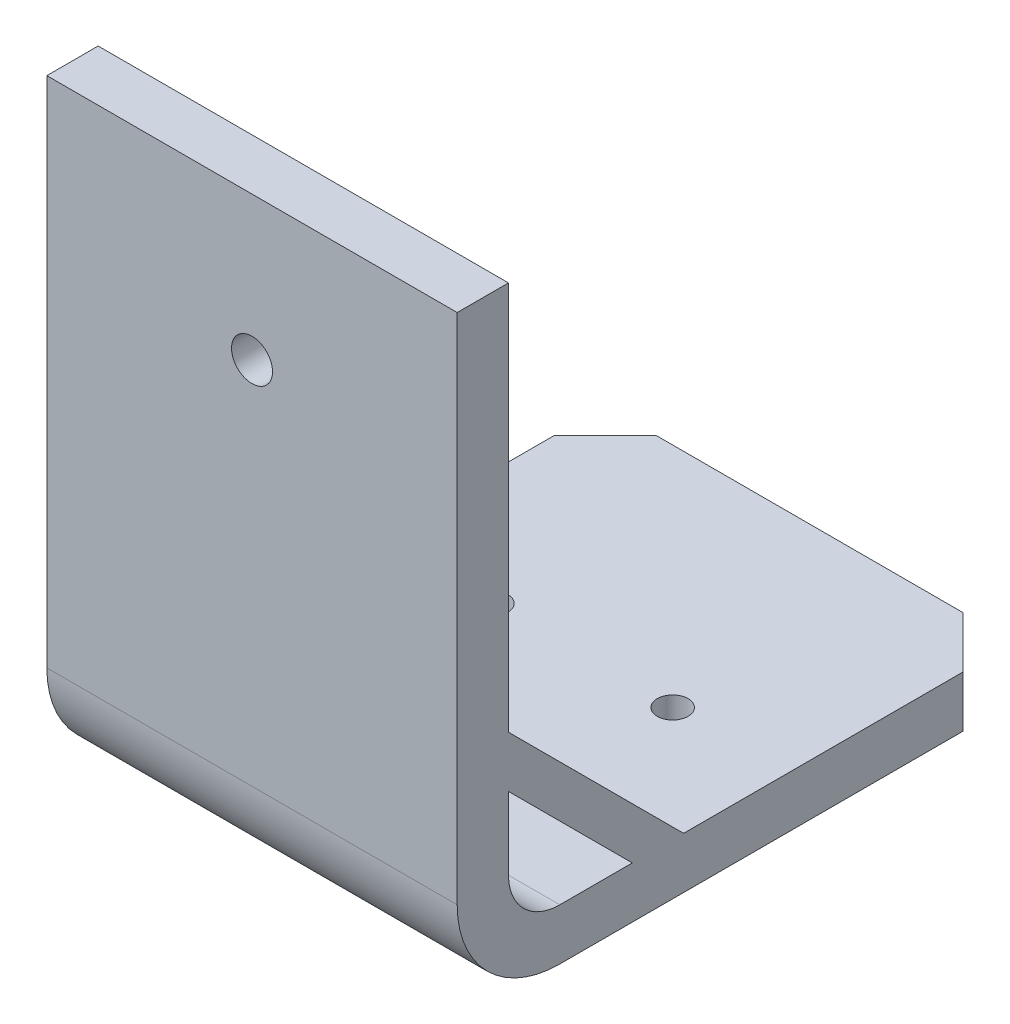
ISO-10303-21;
HEADER;
FILE_DESCRIPTION(('STEP AP214'),'2;1');
FILE_NAME('part.step','',(''),(''),'','','');
FILE_SCHEMA(('AUTOMOTIVE_DESIGN { 1 0 10303 214 1 1 1 1 }'));
ENDSEC;
DATA;
#1=APPLICATION_CONTEXT('core data for automotive mechanical design processes');
#2=APPLICATION_PROTOCOL_DEFINITION('international standard','automotive_design',2000,#1);
#3=PRODUCT_CONTEXT('',#1,'mechanical');
#4=PRODUCT('Part','Part','',(#3));
#5=PRODUCT_RELATED_PRODUCT_CATEGORY('part','',(#4));
#6=PRODUCT_DEFINITION_FORMATION('','',#4);
#7=PRODUCT_DEFINITION_CONTEXT('part definition',#1,'design');
#8=PRODUCT_DEFINITION('design','',#6,#7);
#9=PRODUCT_DEFINITION_SHAPE('','',#8);
#10=(LENGTH_UNIT() NAMED_UNIT(*) SI_UNIT(.MILLI.,.METRE.));
#11=(NAMED_UNIT(*) PLANE_ANGLE_UNIT() SI_UNIT($,.RADIAN.));
#12=(NAMED_UNIT(*) SI_UNIT($,.STERADIAN.) SOLID_ANGLE_UNIT());
#13=UNCERTAINTY_MEASURE_WITH_UNIT(LENGTH_MEASURE(1.E-05),#10,'distance_accuracy_value','');
#14=(GEOMETRIC_REPRESENTATION_CONTEXT(3) GLOBAL_UNCERTAINTY_ASSIGNED_CONTEXT((#13)) GLOBAL_UNIT_ASSIGNED_CONTEXT((#10,
#11,#12)) REPRESENTATION_CONTEXT('',''));
#15=CARTESIAN_POINT('',(0.,0.,0.));
#16=DIRECTION('',(0.,0.,1.));
#17=DIRECTION('',(1.,0.,0.));
#18=AXIS2_PLACEMENT_3D('',#15,#16,#17);
#19=CARTESIAN_POINT('',(0.,5.,0.));
#20=DIRECTION('',(0.,1.,0.));
#21=DIRECTION('',(0.,0.,1.));
#22=AXIS2_PLACEMENT_3D('',#19,#20,#21);
#23=PLANE('',#22);
#24=CARTESIAN_POINT('',(8.78818967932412,5.,0.));
#25=DIRECTION('',(0.,1.,0.));
#26=DIRECTION('',(0.,0.,1.));
#27=AXIS2_PLACEMENT_3D('',#24,#25,#26);
#28=CIRCLE('',#27,1.5);
#29=CARTESIAN_POINT('',(8.78818967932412,5.,1.5));
#30=VERTEX_POINT('',#29);
#31=EDGE_CURVE('E273',#30,#30,#28,.T.);
#32=ORIENTED_EDGE('',*,*,#31,.F.);
#33=EDGE_LOOP('',(#32));
#34=FACE_BOUND('',#33,.T.);
#35=CARTESIAN_POINT('',(-8.78071015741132,5.,0.));
#36=DIRECTION('',(0.,-1.,0.));
#37=DIRECTION('',(0.,0.,-1.));
#38=AXIS2_PLACEMENT_3D('',#35,#36,#37);
#39=CIRCLE('',#38,1.5);
#40=CARTESIAN_POINT('',(-8.78444991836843,5.,-1.49999533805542));
#41=VERTEX_POINT('',#40);
#42=CARTESIAN_POINT('',(-8.78444991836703,5.,1.49999533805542));
#43=VERTEX_POINT('',#42);
#44=EDGE_CURVE('E281',#41,#43,#39,.T.);
#45=ORIENTED_EDGE('',*,*,#44,.T.);
#46=CARTESIAN_POINT('',(-8.78818967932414,5.,0.));
#47=DIRECTION('',(0.,1.,0.));
#48=DIRECTION('',(0.,0.,1.));
#49=AXIS2_PLACEMENT_3D('',#46,#47,#48);
#50=CIRCLE('',#49,1.5);
#51=EDGE_CURVE('E266',#41,#43,#50,.T.);
#52=ORIENTED_EDGE('',*,*,#51,.F.);
#53=EDGE_LOOP('',(#45,#52));
#54=FACE_BOUND('',#53,.T.);
#55=DIRECTION('',(0.,0.,1.));
#56=VECTOR('',#55,1.);
#57=CARTESIAN_POINT('',(-19.9443884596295,5.,-17.1604316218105));
#58=LINE('',#57,#56);
#59=CARTESIAN_POINT('',(-19.9443884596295,5.,-17.1604316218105));
#60=VERTEX_POINT('',#59);
#61=CARTESIAN_POINT('',(-19.9443884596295,5.,10.0893638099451));
#62=VERTEX_POINT('',#61);
#63=EDGE_CURVE('E295',#60,#62,#58,.T.);
#64=ORIENTED_EDGE('',*,*,#63,.T.);
#65=DIRECTION('',(1.,0.,0.));
#66=VECTOR('',#65,1.);
#67=CARTESIAN_POINT('',(-20.0556115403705,5.,10.0893638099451));
#68=LINE('',#67,#66);
#69=CARTESIAN_POINT('',(19.9443884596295,5.,10.0893638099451));
#70=VERTEX_POINT('',#69);
#71=EDGE_CURVE('E376',#62,#70,#68,.T.);
#72=ORIENTED_EDGE('',*,*,#71,.T.);
#73=DIRECTION('',(0.,0.,1.));
#74=VECTOR('',#73,1.);
#75=CARTESIAN_POINT('',(19.9443884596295,5.,-17.1604316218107));
#76=LINE('',#75,#74);
#77=CARTESIAN_POINT('',(19.9443884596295,5.,-17.1604316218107));
#78=VERTEX_POINT('',#77);
#79=EDGE_CURVE('E305',#78,#70,#76,.T.);
#80=ORIENTED_EDGE('',*,*,#79,.F.);
#81=DIRECTION('',(0.707106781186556,0.,0.707106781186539));
#82=VECTOR('',#81,1.);
#83=CARTESIAN_POINT('',(14.9443884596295,5.,-22.1604316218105));
#84=LINE('',#83,#82);
#85=CARTESIAN_POINT('',(14.9443884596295,5.,-22.1604316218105));
#86=VERTEX_POINT('',#85);
#87=EDGE_CURVE('E309',#86,#78,#84,.T.);
#88=ORIENTED_EDGE('',*,*,#87,.F.);
#89=DIRECTION('',(1.,0.,0.));
#90=VECTOR('',#89,1.);
#91=CARTESIAN_POINT('',(-14.9443884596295,5.,-22.1604316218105));
#92=LINE('',#91,#90);
#93=CARTESIAN_POINT('',(-14.9443884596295,5.,-22.1604316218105));
#94=VERTEX_POINT('',#93);
#95=EDGE_CURVE('E313',#94,#86,#92,.T.);
#96=ORIENTED_EDGE('',*,*,#95,.F.);
#97=DIRECTION('',(-0.707106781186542,0.,0.707106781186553));
#98=VECTOR('',#97,1.);
#99=CARTESIAN_POINT('',(-14.9443884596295,5.,-22.1604316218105));
#100=LINE('',#99,#98);
#101=EDGE_CURVE('E289',#94,#60,#100,.T.);
#102=ORIENTED_EDGE('',*,*,#101,.T.);
#103=EDGE_LOOP('',(#64,#72,#80,#88,#96,#102));
#104=FACE_BOUND('',#103,.T.);
#105=ADVANCED_FACE('F48',(#34,#54,#104),#23,.T.);
#106=CARTESIAN_POINT('',(-20.0556115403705,10.,27.1604316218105));
#107=DIRECTION('',(0.,0.,-1.));
#108=DIRECTION('',(-1.,0.,0.));
#109=AXIS2_PLACEMENT_3D('',#106,#107,#108);
#110=PLANE('',#109);
#111=CARTESIAN_POINT('',(-0.0556115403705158,46.,27.1604316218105));
#112=DIRECTION('',(0.,0.,-1.));
#113=DIRECTION('',(-1.,0.,0.));
#114=AXIS2_PLACEMENT_3D('',#111,#112,#113);
#115=CIRCLE('',#114,2.);
#116=CARTESIAN_POINT('',(-2.05561154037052,46.,27.1604316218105));
#117=VERTEX_POINT('',#116);
#118=EDGE_CURVE('E450',#117,#117,#115,.T.);
#119=ORIENTED_EDGE('',*,*,#118,.F.);
#120=EDGE_LOOP('',(#119));
#121=FACE_BOUND('',#120,.T.);
#122=DIRECTION('',(0.,1.,0.));
#123=VECTOR('',#122,1.);
#124=CARTESIAN_POINT('',(19.9443884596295,10.,27.1604316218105));
#125=LINE('',#124,#123);
#126=CARTESIAN_POINT('',(19.9443884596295,22.0710678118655,27.1604316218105));
#127=VERTEX_POINT('',#126);
#128=CARTESIAN_POINT('',(19.9443884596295,60.,27.1604316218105));
#129=VERTEX_POINT('',#128);
#130=EDGE_CURVE('E219',#127,#129,#125,.T.);
#131=ORIENTED_EDGE('',*,*,#130,.F.);
#132=DIRECTION('',(1.,0.,0.));
#133=VECTOR('',#132,1.);
#134=CARTESIAN_POINT('',(-20.0556115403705,22.0710678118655,27.1604316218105));
#135=LINE('',#134,#133);
#136=CARTESIAN_POINT('',(-20.0556115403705,22.0710678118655,27.1604316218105));
#137=VERTEX_POINT('',#136);
#138=EDGE_CURVE('E72',#137,#127,#135,.T.);
#139=ORIENTED_EDGE('',*,*,#138,.F.);
#140=DIRECTION('',(0.,1.,0.));
#141=VECTOR('',#140,1.);
#142=CARTESIAN_POINT('',(-20.0556115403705,10.,27.1604316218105));
#143=LINE('',#142,#141);
#144=CARTESIAN_POINT('',(-20.0556115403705,60.,27.1604316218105));
#145=VERTEX_POINT('',#144);
#146=EDGE_CURVE('E201',#137,#145,#143,.T.);
#147=ORIENTED_EDGE('',*,*,#146,.T.);
#148=DIRECTION('',(1.,0.,0.));
#149=VECTOR('',#148,1.);
#150=CARTESIAN_POINT('',(-20.0556115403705,60.,27.1604316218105));
#151=LINE('',#150,#149);
#152=EDGE_CURVE('E214',#145,#129,#151,.T.);
#153=ORIENTED_EDGE('',*,*,#152,.T.);
#154=EDGE_LOOP('',(#131,#139,#147,#153));
#155=FACE_BOUND('',#154,.T.);
#156=ADVANCED_FACE('F370',(#121,#155),#110,.T.);
#157=CARTESIAN_POINT('',(-8.78071015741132,5.,0.));
#158=DIRECTION('',(0.,-1.,0.));
#159=DIRECTION('',(0.,0.,-1.));
#160=AXIS2_PLACEMENT_3D('',#157,#158,#159);
#161=CYLINDRICAL_SURFACE('',#160,1.5);
#162=DIRECTION('',(0.,-1.,0.));
#163=VECTOR('',#162,1.);
#164=CARTESIAN_POINT('',(-8.78444991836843,2.5,-1.49999533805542));
#165=LINE('',#164,#163);
#166=CARTESIAN_POINT('',(-8.78444991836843,0.,-1.49999533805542));
#167=VERTEX_POINT('',#166);
#168=EDGE_CURVE('E12',#167,#41,#165,.F.);
#169=ORIENTED_EDGE('',*,*,#168,.F.);
#170=CARTESIAN_POINT('',(-8.78071015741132,0.,0.));
#171=DIRECTION('',(0.,-1.,0.));
#172=DIRECTION('',(0.,0.,-1.));
#173=AXIS2_PLACEMENT_3D('',#170,#171,#172);
#174=CIRCLE('',#173,1.5);
#175=CARTESIAN_POINT('',(-8.78444991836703,0.,1.49999533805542));
#176=VERTEX_POINT('',#175);
#177=EDGE_CURVE('E277',#167,#176,#174,.T.);
#178=ORIENTED_EDGE('',*,*,#177,.T.);
#179=DIRECTION('',(0.,-1.,0.));
#180=VECTOR('',#179,1.);
#181=CARTESIAN_POINT('',(-8.78444991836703,2.5,1.49999533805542));
#182=LINE('',#181,#180);
#183=EDGE_CURVE('E57',#43,#176,#182,.T.);
#184=ORIENTED_EDGE('',*,*,#183,.F.);
#185=ORIENTED_EDGE('',*,*,#44,.F.);
#186=EDGE_LOOP('',(#169,#178,#184,#185));
#187=FACE_BOUND('',#186,.T.);
#188=ADVANCED_FACE('F366',(#187),#161,.F.);
#189=CARTESIAN_POINT('',(-14.9443884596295,5.,-22.1604316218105));
#190=DIRECTION('',(0.707106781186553,0.,0.707106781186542));
#191=DIRECTION('',(0.707106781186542,0.,-0.707106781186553));
#192=AXIS2_PLACEMENT_3D('',#189,#190,#191);
#193=PLANE('',#192);
#194=DIRECTION('',(-0.707106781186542,0.,0.707106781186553));
#195=VECTOR('',#194,1.);
#196=CARTESIAN_POINT('',(-14.9443884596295,0.,-22.1604316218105));
#197=LINE('',#196,#195);
#198=CARTESIAN_POINT('',(-14.9443884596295,0.,-22.1604316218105));
#199=VERTEX_POINT('',#198);
#200=CARTESIAN_POINT('',(-19.9443884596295,0.,-17.1604316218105));
#201=VERTEX_POINT('',#200);
#202=EDGE_CURVE('E285',#199,#201,#197,.T.);
#203=ORIENTED_EDGE('',*,*,#202,.T.);
#204=DIRECTION('',(0.,-1.,0.));
#205=VECTOR('',#204,1.);
#206=CARTESIAN_POINT('',(-19.9443884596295,5.,-17.1604316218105));
#207=LINE('',#206,#205);
#208=EDGE_CURVE('E351',#60,#201,#207,.T.);
#209=ORIENTED_EDGE('',*,*,#208,.F.);
#210=ORIENTED_EDGE('',*,*,#101,.F.);
#211=DIRECTION('',(0.,-1.,0.));
#212=VECTOR('',#211,1.);
#213=CARTESIAN_POINT('',(-14.9443884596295,5.,-22.1604316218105));
#214=LINE('',#213,#212);
#215=EDGE_CURVE('E317',#94,#199,#214,.T.);
#216=ORIENTED_EDGE('',*,*,#215,.T.);
#217=EDGE_LOOP('',(#203,#209,#210,#216));
#218=FACE_BOUND('',#217,.T.);
#219=ADVANCED_FACE('F50',(#218),#193,.F.);
#220=CARTESIAN_POINT('',(-19.9443884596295,5.,-17.1604316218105));
#221=DIRECTION('',(1.,0.,0.));
#222=DIRECTION('',(0.,0.,-1.));
#223=AXIS2_PLACEMENT_3D('',#220,#221,#222);
#224=PLANE('',#223);
#225=DIRECTION('',(0.,0.,1.));
#226=VECTOR('',#225,1.);
#227=CARTESIAN_POINT('',(-19.9443884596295,0.,-17.1604316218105));
#228=LINE('',#227,#226);
#229=CARTESIAN_POINT('',(-19.9443884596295,0.,22.1604316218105));
#230=VERTEX_POINT('',#229);
#231=EDGE_CURVE('E321',#201,#230,#228,.T.);
#232=ORIENTED_EDGE('',*,*,#231,.T.);
#233=DIRECTION('',(0.,-1.,0.));
#234=VECTOR('',#233,1.);
#235=CARTESIAN_POINT('',(-19.9443884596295,5.,22.1604316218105));
#236=LINE('',#235,#234);
#237=CARTESIAN_POINT('',(-19.9443884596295,5.,22.1604316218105));
#238=VERTEX_POINT('',#237);
#239=EDGE_CURVE('E347',#238,#230,#236,.T.);
#240=ORIENTED_EDGE('',*,*,#239,.F.);
#241=CARTESIAN_POINT('',(-19.9443884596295,5.,15.0893638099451));
#242=VERTEX_POINT('',#241);
#243=EDGE_CURVE('E293',#242,#238,#58,.T.);
#244=ORIENTED_EDGE('',*,*,#243,.F.);
#245=EDGE_CURVE('E300',#62,#242,#58,.T.);
#246=ORIENTED_EDGE('',*,*,#245,.F.);
#247=ORIENTED_EDGE('',*,*,#63,.F.);
#248=ORIENTED_EDGE('',*,*,#208,.T.);
#249=EDGE_LOOP('',(#232,#240,#244,#246,#247,#248));
#250=FACE_BOUND('',#249,.T.);
#251=ADVANCED_FACE('F382',(#250),#224,.F.);
#252=CARTESIAN_POINT('',(19.9443884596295,5.,-17.1604316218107));
#253=DIRECTION('',(1.,0.,0.));
#254=DIRECTION('',(0.,0.,-1.));
#255=AXIS2_PLACEMENT_3D('',#252,#253,#254);
#256=PLANE('',#255);
#257=DIRECTION('',(0.,-0.707106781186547,-0.707106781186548));
#258=VECTOR('',#257,1.);
#259=CARTESIAN_POINT('',(19.9443884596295,-5.04468190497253,5.04468190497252));
#260=LINE('',#259,#258);
#261=CARTESIAN_POINT('',(19.9443884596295,17.0710678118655,27.1604316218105));
#262=VERTEX_POINT('',#261);
#263=CARTESIAN_POINT('',(19.9443884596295,5.,15.0893638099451));
#264=VERTEX_POINT('',#263);
#265=EDGE_CURVE('E64',#262,#264,#260,.T.);
#266=ORIENTED_EDGE('',*,*,#265,.T.);
#267=CARTESIAN_POINT('',(19.9443884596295,5.,22.1604316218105));
#268=VERTEX_POINT('',#267);
#269=EDGE_CURVE('E304',#264,#268,#76,.T.);
#270=ORIENTED_EDGE('',*,*,#269,.T.);
#271=CARTESIAN_POINT('',(19.9443884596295,10.,22.1604316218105));
#272=DIRECTION('',(-1.,0.,0.));
#273=DIRECTION('',(0.,0.,-1.));
#274=AXIS2_PLACEMENT_3D('',#271,#272,#273);
#275=CIRCLE('',#274,5.);
#276=CARTESIAN_POINT('',(19.9443884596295,10.,27.1604316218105));
#277=VERTEX_POINT('',#276);
#278=EDGE_CURVE('E229',#268,#277,#275,.T.);
#279=ORIENTED_EDGE('',*,*,#278,.T.);
#280=EDGE_CURVE('E215',#277,#262,#125,.T.);
#281=ORIENTED_EDGE('',*,*,#280,.T.);
#282=EDGE_LOOP('',(#266,#270,#279,#281));
#283=FACE_BOUND('',#282,.T.);
#284=DIRECTION('',(0.,0.,1.));
#285=VECTOR('',#284,1.);
#286=CARTESIAN_POINT('',(19.9443884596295,0.,-17.1604316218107));
#287=LINE('',#286,#285);
#288=CARTESIAN_POINT('',(19.9443884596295,0.,-17.1604316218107));
#289=VERTEX_POINT('',#288);
#290=CARTESIAN_POINT('',(19.9443884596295,0.,22.1604316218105));
#291=VERTEX_POINT('',#290);
#292=EDGE_CURVE('E329',#289,#291,#287,.T.);
#293=ORIENTED_EDGE('',*,*,#292,.F.);
#294=DIRECTION('',(0.,-1.,0.));
#295=VECTOR('',#294,1.);
#296=CARTESIAN_POINT('',(19.9443884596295,5.,-17.1604316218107));
#297=LINE('',#296,#295);
#298=EDGE_CURVE('E344',#78,#289,#297,.T.);
#299=ORIENTED_EDGE('',*,*,#298,.F.);
#300=ORIENTED_EDGE('',*,*,#79,.T.);
#301=DIRECTION('',(0.,-0.707106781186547,-0.707106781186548));
#302=VECTOR('',#301,1.);
#303=CARTESIAN_POINT('',(19.9443884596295,-2.54468190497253,2.54468190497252));
#304=LINE('',#303,#302);
#305=EDGE_CURVE('E194',#127,#70,#304,.T.);
#306=ORIENTED_EDGE('',*,*,#305,.F.);
#307=ORIENTED_EDGE('',*,*,#130,.T.);
#308=DIRECTION('',(0.,0.,1.));
#309=VECTOR('',#308,1.);
#310=CARTESIAN_POINT('',(19.9443884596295,60.,32.1604316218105));
#311=LINE('',#310,#309);
#312=CARTESIAN_POINT('',(19.9443884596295,60.,32.1604316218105));
#313=VERTEX_POINT('',#312);
#314=EDGE_CURVE('E218',#129,#313,#311,.T.);
#315=ORIENTED_EDGE('',*,*,#314,.T.);
#316=DIRECTION('',(0.,-1.,0.));
#317=VECTOR('',#316,1.);
#318=CARTESIAN_POINT('',(19.9443884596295,9.99999999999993,32.1604316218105));
#319=LINE('',#318,#317);
#320=CARTESIAN_POINT('',(19.9443884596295,9.99999999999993,32.1604316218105));
#321=VERTEX_POINT('',#320);
#322=EDGE_CURVE('E208',#313,#321,#319,.T.);
#323=ORIENTED_EDGE('',*,*,#322,.T.);
#324=CARTESIAN_POINT('',(19.9443884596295,10.,22.1604316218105));
#325=DIRECTION('',(1.,0.,0.));
#326=DIRECTION('',(0.,0.,-1.));
#327=AXIS2_PLACEMENT_3D('',#324,#325,#326);
#328=CIRCLE('',#327,10.);
#329=EDGE_CURVE('E237',#321,#291,#328,.T.);
#330=ORIENTED_EDGE('',*,*,#329,.T.);
#331=EDGE_LOOP('',(#293,#299,#300,#306,#307,#315,#323,#330));
#332=FACE_BOUND('',#331,.T.);
#333=ADVANCED_FACE('F401',(#283,#332),#256,.T.);
#334=CARTESIAN_POINT('',(14.9443884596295,5.,-22.1604316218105));
#335=DIRECTION('',(0.707106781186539,0.,-0.707106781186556));
#336=DIRECTION('',(-0.707106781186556,0.,-0.707106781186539));
#337=AXIS2_PLACEMENT_3D('',#334,#335,#336);
#338=PLANE('',#337);
#339=DIRECTION('',(0.707106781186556,0.,0.707106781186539));
#340=VECTOR('',#339,1.);
#341=CARTESIAN_POINT('',(14.9443884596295,0.,-22.1604316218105));
#342=LINE('',#341,#340);
#343=CARTESIAN_POINT('',(14.9443884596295,0.,-22.1604316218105));
#344=VERTEX_POINT('',#343);
#345=EDGE_CURVE('E332',#344,#289,#342,.T.);
#346=ORIENTED_EDGE('',*,*,#345,.F.);
#347=DIRECTION('',(0.,-1.,0.));
#348=VECTOR('',#347,1.);
#349=CARTESIAN_POINT('',(14.9443884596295,5.,-22.1604316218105));
#350=LINE('',#349,#348);
#351=EDGE_CURVE('E341',#86,#344,#350,.T.);
#352=ORIENTED_EDGE('',*,*,#351,.F.);
#353=ORIENTED_EDGE('',*,*,#87,.T.);
#354=ORIENTED_EDGE('',*,*,#298,.T.);
#355=EDGE_LOOP('',(#346,#352,#353,#354));
#356=FACE_BOUND('',#355,.T.);
#357=ADVANCED_FACE('F405',(#356),#338,.T.);
#358=CARTESIAN_POINT('',(-14.9443884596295,5.,-22.1604316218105));
#359=DIRECTION('',(0.,0.,-1.));
#360=DIRECTION('',(-1.,0.,0.));
#361=AXIS2_PLACEMENT_3D('',#358,#359,#360);
#362=PLANE('',#361);
#363=DIRECTION('',(1.,0.,0.));
#364=VECTOR('',#363,1.);
#365=CARTESIAN_POINT('',(-14.9443884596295,0.,-22.1604316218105));
#366=LINE('',#365,#364);
#367=EDGE_CURVE('E294',#199,#344,#366,.T.);
#368=ORIENTED_EDGE('',*,*,#367,.F.);
#369=ORIENTED_EDGE('',*,*,#215,.F.);
#370=ORIENTED_EDGE('',*,*,#95,.T.);
#371=ORIENTED_EDGE('',*,*,#351,.T.);
#372=EDGE_LOOP('',(#368,#369,#370,#371));
#373=FACE_BOUND('',#372,.T.);
#374=ADVANCED_FACE('F415',(#373),#362,.T.);
#375=DIRECTION('',(1.,0.,0.));
#376=VECTOR('',#375,1.);
#377=CARTESIAN_POINT('',(-20.0556115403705,5.,15.0893638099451));
#378=LINE('',#377,#376);
#379=EDGE_CURVE('E182',#242,#264,#378,.T.);
#380=ORIENTED_EDGE('',*,*,#379,.F.);
#381=ORIENTED_EDGE('',*,*,#243,.T.);
#382=DIRECTION('',(1.,0.,0.));
#383=VECTOR('',#382,1.);
#384=CARTESIAN_POINT('',(-19.9443884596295,5.,22.1604316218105));
#385=LINE('',#384,#383);
#386=EDGE_CURVE('E299',#238,#268,#385,.T.);
#387=ORIENTED_EDGE('',*,*,#386,.T.);
#388=ORIENTED_EDGE('',*,*,#269,.F.);
#389=EDGE_LOOP('',(#380,#381,#387,#388));
#390=FACE_BOUND('',#389,.T.);
#391=ADVANCED_FACE('F373',(#390),#23,.T.);
#392=CARTESIAN_POINT('',(0.,0.,0.));
#393=DIRECTION('',(0.,1.,0.));
#394=DIRECTION('',(0.,0.,1.));
#395=AXIS2_PLACEMENT_3D('',#392,#393,#394);
#396=PLANE('',#395);
#397=CARTESIAN_POINT('',(-8.78818967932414,0.,0.));
#398=DIRECTION('',(0.,1.,0.));
#399=DIRECTION('',(0.,0.,1.));
#400=AXIS2_PLACEMENT_3D('',#397,#398,#399);
#401=CIRCLE('',#400,1.5);
#402=EDGE_CURVE('E255',#167,#176,#401,.T.);
#403=ORIENTED_EDGE('',*,*,#402,.T.);
#404=ORIENTED_EDGE('',*,*,#177,.F.);
#405=EDGE_LOOP('',(#403,#404));
#406=FACE_BOUND('',#405,.T.);
#407=CARTESIAN_POINT('',(8.78818967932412,0.,0.));
#408=DIRECTION('',(0.,1.,0.));
#409=DIRECTION('',(0.,0.,1.));
#410=AXIS2_PLACEMENT_3D('',#407,#408,#409);
#411=CIRCLE('',#410,1.5);
#412=CARTESIAN_POINT('',(8.78818967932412,0.,1.5));
#413=VERTEX_POINT('',#412);
#414=EDGE_CURVE('E269',#413,#413,#411,.T.);
#415=ORIENTED_EDGE('',*,*,#414,.T.);
#416=EDGE_LOOP('',(#415));
#417=FACE_BOUND('',#416,.T.);
#418=ORIENTED_EDGE('',*,*,#202,.F.);
#419=ORIENTED_EDGE('',*,*,#367,.T.);
#420=ORIENTED_EDGE('',*,*,#345,.T.);
#421=ORIENTED_EDGE('',*,*,#292,.T.);
#422=DIRECTION('',(1.,0.,0.));
#423=VECTOR('',#422,1.);
#424=CARTESIAN_POINT('',(-19.9443884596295,0.,22.1604316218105));
#425=LINE('',#424,#423);
#426=EDGE_CURVE('E325',#230,#291,#425,.T.);
#427=ORIENTED_EDGE('',*,*,#426,.F.);
#428=ORIENTED_EDGE('',*,*,#231,.F.);
#429=EDGE_LOOP('',(#418,#419,#420,#421,#427,#428));
#430=FACE_BOUND('',#429,.T.);
#431=ADVANCED_FACE('F364',(#406,#417,#430),#396,.F.);
#432=CARTESIAN_POINT('',(-8.78818967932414,5.,0.));
#433=DIRECTION('',(0.,-1.,0.));
#434=DIRECTION('',(0.,0.,-1.));
#435=AXIS2_PLACEMENT_3D('',#432,#433,#434);
#436=CYLINDRICAL_SURFACE('',#435,1.5);
#437=ORIENTED_EDGE('',*,*,#168,.T.);
#438=ORIENTED_EDGE('',*,*,#51,.T.);
#439=ORIENTED_EDGE('',*,*,#183,.T.);
#440=ORIENTED_EDGE('',*,*,#402,.F.);
#441=EDGE_LOOP('',(#437,#438,#439,#440));
#442=FACE_BOUND('',#441,.T.);
#443=ADVANCED_FACE('F357',(#442),#436,.F.);
#444=CARTESIAN_POINT('',(8.78818967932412,5.,0.));
#445=DIRECTION('',(0.,-1.,0.));
#446=DIRECTION('',(0.,0.,-1.));
#447=AXIS2_PLACEMENT_3D('',#444,#445,#446);
#448=CYLINDRICAL_SURFACE('',#447,1.5);
#449=ORIENTED_EDGE('',*,*,#31,.T.);
#450=EDGE_LOOP('',(#449));
#451=FACE_BOUND('',#450,.T.);
#452=ORIENTED_EDGE('',*,*,#414,.F.);
#453=EDGE_LOOP('',(#452));
#454=FACE_BOUND('',#453,.T.);
#455=ADVANCED_FACE('F483',(#451,#454),#448,.F.);
#456=CARTESIAN_POINT('',(-20.0556115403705,10.,22.1604316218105));
#457=DIRECTION('',(1.,0.,0.));
#458=DIRECTION('',(0.,0.,-1.));
#459=AXIS2_PLACEMENT_3D('',#456,#457,#458);
#460=CYLINDRICAL_SURFACE('',#459,5.);
#461=ORIENTED_EDGE('',*,*,#278,.F.);
#462=ORIENTED_EDGE('',*,*,#386,.F.);
#463=DIRECTION('',(1.,0.,0.));
#464=VECTOR('',#463,1.);
#465=CARTESIAN_POINT('',(-20.0556115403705,5.,22.1604316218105));
#466=LINE('',#465,#464);
#467=CARTESIAN_POINT('',(-20.0556115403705,5.,22.1604316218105));
#468=VERTEX_POINT('',#467);
#469=EDGE_CURVE('E251',#468,#238,#466,.T.);
#470=ORIENTED_EDGE('',*,*,#469,.F.);
#471=CARTESIAN_POINT('',(-20.0556115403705,10.,22.1604316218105));
#472=DIRECTION('',(-1.,0.,0.));
#473=DIRECTION('',(0.,0.,-1.));
#474=AXIS2_PLACEMENT_3D('',#471,#472,#473);
#475=CIRCLE('',#474,5.);
#476=CARTESIAN_POINT('',(-20.0556115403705,10.,27.1604316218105));
#477=VERTEX_POINT('',#476);
#478=EDGE_CURVE('E233',#468,#477,#475,.T.);
#479=ORIENTED_EDGE('',*,*,#478,.T.);
#480=DIRECTION('',(1.,0.,0.));
#481=VECTOR('',#480,1.);
#482=CARTESIAN_POINT('',(-20.0556115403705,10.,27.1604316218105));
#483=LINE('',#482,#481);
#484=EDGE_CURVE('E198',#477,#277,#483,.T.);
#485=ORIENTED_EDGE('',*,*,#484,.T.);
#486=EDGE_LOOP('',(#461,#462,#470,#479,#485));
#487=FACE_BOUND('',#486,.T.);
#488=ADVANCED_FACE('F396',(#487),#460,.F.);
#489=CARTESIAN_POINT('',(-20.0556115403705,5.,22.1604316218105));
#490=DIRECTION('',(0.,0.,-1.));
#491=DIRECTION('',(-1.,0.,0.));
#492=AXIS2_PLACEMENT_3D('',#489,#490,#491);
#493=PLANE('',#492);
#494=ORIENTED_EDGE('',*,*,#469,.T.);
#495=ORIENTED_EDGE('',*,*,#239,.T.);
#496=DIRECTION('',(1.,0.,0.));
#497=VECTOR('',#496,1.);
#498=CARTESIAN_POINT('',(-20.0556115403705,0.,22.1604316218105));
#499=LINE('',#498,#497);
#500=CARTESIAN_POINT('',(-20.0556115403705,0.,22.1604316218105));
#501=VERTEX_POINT('',#500);
#502=EDGE_CURVE('E256',#501,#230,#499,.T.);
#503=ORIENTED_EDGE('',*,*,#502,.F.);
#504=DIRECTION('',(0.,1.,0.));
#505=VECTOR('',#504,1.);
#506=CARTESIAN_POINT('',(-20.0556115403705,5.,22.1604316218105));
#507=LINE('',#506,#505);
#508=EDGE_CURVE('E241',#501,#468,#507,.T.);
#509=ORIENTED_EDGE('',*,*,#508,.T.);
#510=EDGE_LOOP('',(#494,#495,#503,#509));
#511=FACE_BOUND('',#510,.T.);
#512=ADVANCED_FACE('F397',(#511),#493,.T.);
#513=CARTESIAN_POINT('',(-20.0556115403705,10.,22.1604316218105));
#514=DIRECTION('',(1.,0.,0.));
#515=DIRECTION('',(0.,0.,-1.));
#516=AXIS2_PLACEMENT_3D('',#513,#514,#515);
#517=CYLINDRICAL_SURFACE('',#516,10.);
#518=ORIENTED_EDGE('',*,*,#329,.F.);
#519=DIRECTION('',(1.,0.,0.));
#520=VECTOR('',#519,1.);
#521=CARTESIAN_POINT('',(-20.0556115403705,10.,32.1604316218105));
#522=LINE('',#521,#520);
#523=CARTESIAN_POINT('',(-20.0556115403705,10.,32.1604316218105));
#524=VERTEX_POINT('',#523);
#525=EDGE_CURVE('E260',#524,#321,#522,.T.);
#526=ORIENTED_EDGE('',*,*,#525,.F.);
#527=CARTESIAN_POINT('',(-20.0556115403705,10.,22.1604316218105));
#528=DIRECTION('',(1.,0.,0.));
#529=DIRECTION('',(0.,0.,-1.));
#530=AXIS2_PLACEMENT_3D('',#527,#528,#529);
#531=CIRCLE('',#530,10.);
#532=EDGE_CURVE('E236',#524,#501,#531,.T.);
#533=ORIENTED_EDGE('',*,*,#532,.T.);
#534=ORIENTED_EDGE('',*,*,#502,.T.);
#535=ORIENTED_EDGE('',*,*,#426,.T.);
#536=EDGE_LOOP('',(#518,#526,#533,#534,#535));
#537=FACE_BOUND('',#536,.T.);
#538=ADVANCED_FACE('F418',(#537),#517,.T.);
#539=CARTESIAN_POINT('',(-20.0556115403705,10.,22.1604316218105));
#540=DIRECTION('',(1.,0.,0.));
#541=DIRECTION('',(0.,0.,-1.));
#542=AXIS2_PLACEMENT_3D('',#539,#540,#541);
#543=PLANE('',#542);
#544=ORIENTED_EDGE('',*,*,#478,.F.);
#545=ORIENTED_EDGE('',*,*,#508,.F.);
#546=ORIENTED_EDGE('',*,*,#532,.F.);
#547=DIRECTION('',(0.,-1.,0.));
#548=VECTOR('',#547,1.);
#549=CARTESIAN_POINT('',(-20.0556115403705,9.99999999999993,32.1604316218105));
#550=LINE('',#549,#548);
#551=CARTESIAN_POINT('',(-20.0556115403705,60.,32.1604316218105));
#552=VERTEX_POINT('',#551);
#553=EDGE_CURVE('E206',#552,#524,#550,.T.);
#554=ORIENTED_EDGE('',*,*,#553,.F.);
#555=DIRECTION('',(0.,0.,1.));
#556=VECTOR('',#555,1.);
#557=CARTESIAN_POINT('',(-20.0556115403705,60.,32.1604316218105));
#558=LINE('',#557,#556);
#559=EDGE_CURVE('E200',#145,#552,#558,.T.);
#560=ORIENTED_EDGE('',*,*,#559,.F.);
#561=ORIENTED_EDGE('',*,*,#146,.F.);
#562=DIRECTION('',(0.,-0.707106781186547,-0.707106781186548));
#563=VECTOR('',#562,1.);
#564=CARTESIAN_POINT('',(-20.0556115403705,-2.54468190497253,2.54468190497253));
#565=LINE('',#564,#563);
#566=CARTESIAN_POINT('',(-20.0556115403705,5.,10.0893638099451));
#567=VERTEX_POINT('',#566);
#568=EDGE_CURVE('E183',#137,#567,#565,.T.);
#569=ORIENTED_EDGE('',*,*,#568,.T.);
#570=DIRECTION('',(0.,0.,1.));
#571=VECTOR('',#570,1.);
#572=CARTESIAN_POINT('',(-20.0556115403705,5.,0.));
#573=LINE('',#572,#571);
#574=CARTESIAN_POINT('',(-20.0556115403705,5.,15.0893638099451));
#575=VERTEX_POINT('',#574);
#576=EDGE_CURVE('E191',#567,#575,#573,.T.);
#577=ORIENTED_EDGE('',*,*,#576,.T.);
#578=DIRECTION('',(0.,-0.707106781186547,-0.707106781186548));
#579=VECTOR('',#578,1.);
#580=CARTESIAN_POINT('',(-20.0556115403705,-5.04468190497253,5.04468190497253));
#581=LINE('',#580,#579);
#582=CARTESIAN_POINT('',(-20.0556115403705,17.0710678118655,27.1604316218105));
#583=VERTEX_POINT('',#582);
#584=EDGE_CURVE('E177',#583,#575,#581,.T.);
#585=ORIENTED_EDGE('',*,*,#584,.F.);
#586=EDGE_CURVE('E189',#477,#583,#143,.T.);
#587=ORIENTED_EDGE('',*,*,#586,.F.);
#588=EDGE_LOOP('',(#544,#545,#546,#554,#560,#561,#569,#577,#585,#587));
#589=FACE_BOUND('',#588,.T.);
#590=ADVANCED_FACE('F188',(#589),#543,.F.);
#591=CARTESIAN_POINT('',(-20.0556115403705,9.99999999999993,32.1604316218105));
#592=DIRECTION('',(0.,0.,1.));
#593=DIRECTION('',(1.,0.,0.));
#594=AXIS2_PLACEMENT_3D('',#591,#592,#593);
#595=PLANE('',#594);
#596=CARTESIAN_POINT('',(-0.0556115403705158,46.,32.1604316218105));
#597=DIRECTION('',(0.,0.,1.));
#598=DIRECTION('',(1.,0.,0.));
#599=AXIS2_PLACEMENT_3D('',#596,#597,#598);
#600=CIRCLE('',#599,2.);
#601=CARTESIAN_POINT('',(1.94438845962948,46.,32.1604316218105));
#602=VERTEX_POINT('',#601);
#603=EDGE_CURVE('E453',#602,#602,#600,.T.);
#604=ORIENTED_EDGE('',*,*,#603,.F.);
#605=EDGE_LOOP('',(#604));
#606=FACE_BOUND('',#605,.T.);
#607=ORIENTED_EDGE('',*,*,#322,.F.);
#608=DIRECTION('',(1.,0.,0.));
#609=VECTOR('',#608,1.);
#610=CARTESIAN_POINT('',(-20.0556115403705,60.,32.1604316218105));
#611=LINE('',#610,#609);
#612=EDGE_CURVE('E226',#552,#313,#611,.T.);
#613=ORIENTED_EDGE('',*,*,#612,.F.);
#614=ORIENTED_EDGE('',*,*,#553,.T.);
#615=ORIENTED_EDGE('',*,*,#525,.T.);
#616=EDGE_LOOP('',(#607,#613,#614,#615));
#617=FACE_BOUND('',#616,.T.);
#618=ADVANCED_FACE('F421',(#606,#617),#595,.T.);
#619=CARTESIAN_POINT('',(-20.0556115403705,60.,32.1604316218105));
#620=DIRECTION('',(0.,1.,0.));
#621=DIRECTION('',(0.,0.,1.));
#622=AXIS2_PLACEMENT_3D('',#619,#620,#621);
#623=PLANE('',#622);
#624=ORIENTED_EDGE('',*,*,#314,.F.);
#625=ORIENTED_EDGE('',*,*,#152,.F.);
#626=ORIENTED_EDGE('',*,*,#559,.T.);
#627=ORIENTED_EDGE('',*,*,#612,.T.);
#628=EDGE_LOOP('',(#624,#625,#626,#627));
#629=FACE_BOUND('',#628,.T.);
#630=ADVANCED_FACE('F426',(#629),#623,.T.);
#631=DIRECTION('',(1.,0.,0.));
#632=VECTOR('',#631,1.);
#633=CARTESIAN_POINT('',(-20.0556115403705,17.0710678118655,27.1604316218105));
#634=LINE('',#633,#632);
#635=EDGE_CURVE('E173',#583,#262,#634,.T.);
#636=ORIENTED_EDGE('',*,*,#635,.T.);
#637=ORIENTED_EDGE('',*,*,#280,.F.);
#638=ORIENTED_EDGE('',*,*,#484,.F.);
#639=ORIENTED_EDGE('',*,*,#586,.T.);
#640=EDGE_LOOP('',(#636,#637,#638,#639));
#641=FACE_BOUND('',#640,.T.);
#642=ADVANCED_FACE('F197',(#641),#110,.T.);
#643=CARTESIAN_POINT('',(-20.0556115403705,5.,0.));
#644=DIRECTION('',(0.,1.,0.));
#645=DIRECTION('',(0.,0.,1.));
#646=AXIS2_PLACEMENT_3D('',#643,#644,#645);
#647=PLANE('',#646);
#648=EDGE_CURVE('E432',#567,#62,#68,.T.);
#649=ORIENTED_EDGE('',*,*,#648,.T.);
#650=ORIENTED_EDGE('',*,*,#245,.T.);
#651=EDGE_CURVE('E439',#575,#242,#378,.T.);
#652=ORIENTED_EDGE('',*,*,#651,.F.);
#653=ORIENTED_EDGE('',*,*,#576,.F.);
#654=EDGE_LOOP('',(#649,#650,#652,#653));
#655=FACE_BOUND('',#654,.T.);
#656=ADVANCED_FACE('F475',(#655),#647,.F.);
#657=CARTESIAN_POINT('',(-20.0556115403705,-2.54468190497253,2.54468190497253));
#658=DIRECTION('',(0.,-0.707106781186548,0.707106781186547));
#659=DIRECTION('',(0.,-0.707106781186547,-0.707106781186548));
#660=AXIS2_PLACEMENT_3D('',#657,#658,#659);
#661=PLANE('',#660);
#662=ORIENTED_EDGE('',*,*,#305,.T.);
#663=ORIENTED_EDGE('',*,*,#71,.F.);
#664=ORIENTED_EDGE('',*,*,#648,.F.);
#665=ORIENTED_EDGE('',*,*,#568,.F.);
#666=ORIENTED_EDGE('',*,*,#138,.T.);
#667=EDGE_LOOP('',(#662,#663,#664,#665,#666));
#668=FACE_BOUND('',#667,.T.);
#669=ADVANCED_FACE('F590',(#668),#661,.F.);
#670=CARTESIAN_POINT('',(-20.0556115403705,-5.04468190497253,5.04468190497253));
#671=DIRECTION('',(0.,-0.707106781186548,0.707106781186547));
#672=DIRECTION('',(0.,-0.707106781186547,-0.707106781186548));
#673=AXIS2_PLACEMENT_3D('',#670,#671,#672);
#674=PLANE('',#673);
#675=ORIENTED_EDGE('',*,*,#265,.F.);
#676=ORIENTED_EDGE('',*,*,#635,.F.);
#677=ORIENTED_EDGE('',*,*,#584,.T.);
#678=ORIENTED_EDGE('',*,*,#651,.T.);
#679=ORIENTED_EDGE('',*,*,#379,.T.);
#680=EDGE_LOOP('',(#675,#676,#677,#678,#679));
#681=FACE_BOUND('',#680,.T.);
#682=ADVANCED_FACE('F175',(#681),#674,.T.);
#683=CARTESIAN_POINT('',(-0.0556115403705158,46.,-22.1604316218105));
#684=DIRECTION('',(0.,0.,1.));
#685=DIRECTION('',(1.,0.,0.));
#686=AXIS2_PLACEMENT_3D('',#683,#684,#685);
#687=CYLINDRICAL_SURFACE('',#686,2.);
#688=ORIENTED_EDGE('',*,*,#118,.T.);
#689=EDGE_LOOP('',(#688));
#690=FACE_BOUND('',#689,.T.);
#691=ORIENTED_EDGE('',*,*,#603,.T.);
#692=EDGE_LOOP('',(#691));
#693=FACE_BOUND('',#692,.T.);
#694=ADVANCED_FACE('F459',(#690,#693),#687,.F.);
#695=CLOSED_SHELL('',(#105,#156,#188,#219,#251,#333,#357,#374,#391,#431,#443,#455,#488,#512,
#538,#590,#618,#630,#642,#656,#669,#682,#694));
#696=MANIFOLD_SOLID_BREP('B2',#695);
#697=ADVANCED_BREP_SHAPE_REPRESENTATION('',(#18,#696),#14);
#698=SHAPE_DEFINITION_REPRESENTATION(#9,#697);
ENDSEC;
END-ISO-10303-21;
